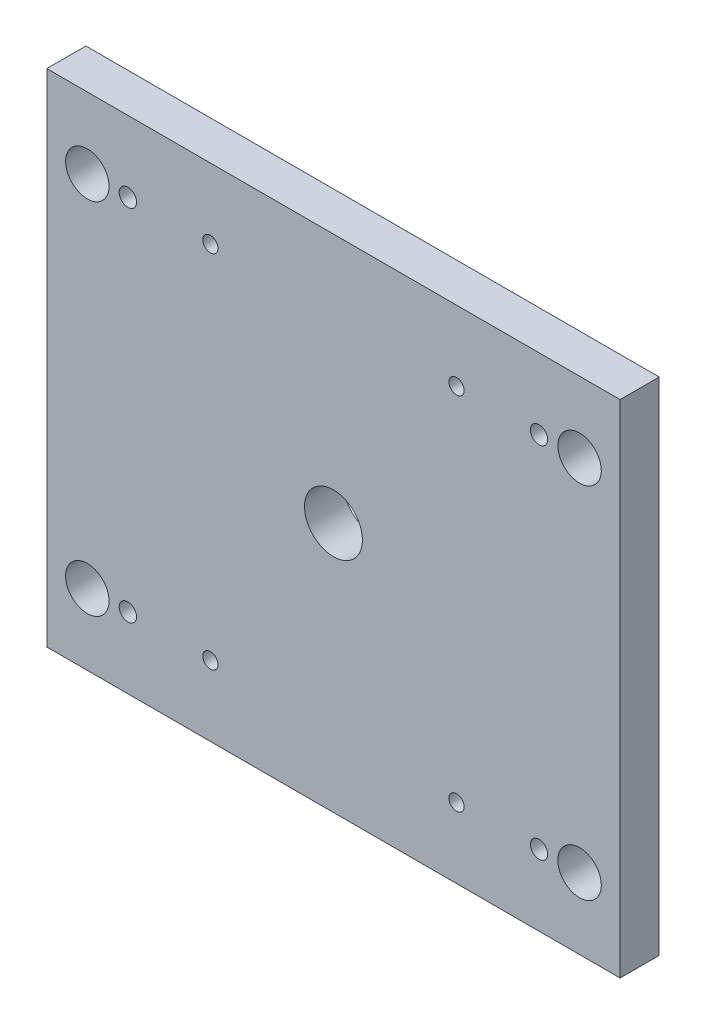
ISO-10303-21;
HEADER;
FILE_DESCRIPTION(('STEP AP214'),'2;1');
FILE_NAME('part.step','',(''),(''),'','','');
FILE_SCHEMA(('AUTOMOTIVE_DESIGN { 1 0 10303 214 1 1 1 1 }'));
ENDSEC;
DATA;
#1=APPLICATION_CONTEXT('core data for automotive mechanical design processes');
#2=APPLICATION_PROTOCOL_DEFINITION('international standard','automotive_design',2000,#1);
#3=PRODUCT_CONTEXT('',#1,'mechanical');
#4=PRODUCT('Part','Part','',(#3));
#5=PRODUCT_RELATED_PRODUCT_CATEGORY('part','',(#4));
#6=PRODUCT_DEFINITION_FORMATION('','',#4);
#7=PRODUCT_DEFINITION_CONTEXT('part definition',#1,'design');
#8=PRODUCT_DEFINITION('design','',#6,#7);
#9=PRODUCT_DEFINITION_SHAPE('','',#8);
#10=(LENGTH_UNIT() NAMED_UNIT(*) SI_UNIT(.MILLI.,.METRE.));
#11=(NAMED_UNIT(*) PLANE_ANGLE_UNIT() SI_UNIT($,.RADIAN.));
#12=(NAMED_UNIT(*) SI_UNIT($,.STERADIAN.) SOLID_ANGLE_UNIT());
#13=UNCERTAINTY_MEASURE_WITH_UNIT(LENGTH_MEASURE(1.E-05),#10,'distance_accuracy_value','');
#14=(GEOMETRIC_REPRESENTATION_CONTEXT(3) GLOBAL_UNCERTAINTY_ASSIGNED_CONTEXT((#13)) GLOBAL_UNIT_ASSIGNED_CONTEXT((#10,
#11,#12)) REPRESENTATION_CONTEXT('',''));
#15=CARTESIAN_POINT('',(0.,0.,0.));
#16=DIRECTION('',(0.,0.,1.));
#17=DIRECTION('',(1.,0.,0.));
#18=AXIS2_PLACEMENT_3D('',#15,#16,#17);
#19=CARTESIAN_POINT('',(-198.,-173.,-195.));
#20=DIRECTION('',(1.,0.,0.));
#21=DIRECTION('',(0.,1.,0.));
#22=AXIS2_PLACEMENT_3D('',#19,#20,#21);
#23=PLANE('',#22);
#24=DIRECTION('',(0.,1.,0.));
#25=VECTOR('',#24,1.);
#26=CARTESIAN_POINT('',(-198.,-173.,-168.));
#27=LINE('',#26,#25);
#28=CARTESIAN_POINT('',(-198.,-173.,-168.));
#29=VERTEX_POINT('',#28);
#30=CARTESIAN_POINT('',(-198.,173.,-168.));
#31=VERTEX_POINT('',#30);
#32=EDGE_CURVE('E77',#29,#31,#27,.T.);
#33=ORIENTED_EDGE('',*,*,#32,.T.);
#34=DIRECTION('',(0.,0.,1.));
#35=VECTOR('',#34,1.);
#36=CARTESIAN_POINT('',(-198.,173.,-195.));
#37=LINE('',#36,#35);
#38=CARTESIAN_POINT('',(-198.,173.,-195.));
#39=VERTEX_POINT('',#38);
#40=EDGE_CURVE('E11',#39,#31,#37,.T.);
#41=ORIENTED_EDGE('',*,*,#40,.F.);
#42=DIRECTION('',(0.,1.,0.));
#43=VECTOR('',#42,1.);
#44=CARTESIAN_POINT('',(-198.,-173.,-195.));
#45=LINE('',#44,#43);
#46=CARTESIAN_POINT('',(-198.,-173.,-195.));
#47=VERTEX_POINT('',#46);
#48=EDGE_CURVE('E67',#47,#39,#45,.T.);
#49=ORIENTED_EDGE('',*,*,#48,.F.);
#50=DIRECTION('',(0.,0.,1.));
#51=VECTOR('',#50,1.);
#52=CARTESIAN_POINT('',(-198.,-173.,-195.));
#53=LINE('',#52,#51);
#54=EDGE_CURVE('E78',#47,#29,#53,.T.);
#55=ORIENTED_EDGE('',*,*,#54,.T.);
#56=EDGE_LOOP('',(#33,#41,#49,#55));
#57=FACE_BOUND('',#56,.T.);
#58=ADVANCED_FACE('F16',(#57),#23,.F.);
#59=CARTESIAN_POINT('',(0.,173.,-195.));
#60=DIRECTION('',(0.,-1.,0.));
#61=DIRECTION('',(1.,0.,0.));
#62=AXIS2_PLACEMENT_3D('',#59,#60,#61);
#63=PLANE('',#62);
#64=DIRECTION('',(1.,0.,0.));
#65=VECTOR('',#64,1.);
#66=CARTESIAN_POINT('',(0.,173.,-168.));
#67=LINE('',#66,#65);
#68=CARTESIAN_POINT('',(198.,173.,-168.));
#69=VERTEX_POINT('',#68);
#70=EDGE_CURVE('E49',#31,#69,#67,.T.);
#71=ORIENTED_EDGE('',*,*,#70,.T.);
#72=DIRECTION('',(0.,0.,1.));
#73=VECTOR('',#72,1.);
#74=CARTESIAN_POINT('',(198.,173.,-195.));
#75=LINE('',#74,#73);
#76=CARTESIAN_POINT('',(198.,173.,-195.));
#77=VERTEX_POINT('',#76);
#78=EDGE_CURVE('E25',#77,#69,#75,.T.);
#79=ORIENTED_EDGE('',*,*,#78,.F.);
#80=DIRECTION('',(1.,0.,0.));
#81=VECTOR('',#80,1.);
#82=CARTESIAN_POINT('',(-198.,173.,-195.));
#83=LINE('',#82,#81);
#84=EDGE_CURVE('E63',#39,#77,#83,.T.);
#85=ORIENTED_EDGE('',*,*,#84,.F.);
#86=ORIENTED_EDGE('',*,*,#40,.T.);
#87=EDGE_LOOP('',(#71,#79,#85,#86));
#88=FACE_BOUND('',#87,.T.);
#89=ADVANCED_FACE('F64',(#88),#63,.F.);
#90=CARTESIAN_POINT('',(198.,173.,-195.));
#91=DIRECTION('',(-1.,0.,0.));
#92=DIRECTION('',(0.,-1.,0.));
#93=AXIS2_PLACEMENT_3D('',#90,#91,#92);
#94=PLANE('',#93);
#95=DIRECTION('',(0.,-1.,0.));
#96=VECTOR('',#95,1.);
#97=CARTESIAN_POINT('',(198.,173.,-168.));
#98=LINE('',#97,#96);
#99=CARTESIAN_POINT('',(198.,-173.,-168.));
#100=VERTEX_POINT('',#99);
#101=EDGE_CURVE('E55',#69,#100,#98,.T.);
#102=ORIENTED_EDGE('',*,*,#101,.T.);
#103=DIRECTION('',(0.,0.,1.));
#104=VECTOR('',#103,1.);
#105=CARTESIAN_POINT('',(198.,-173.,-195.));
#106=LINE('',#105,#104);
#107=CARTESIAN_POINT('',(198.,-173.,-195.));
#108=VERTEX_POINT('',#107);
#109=EDGE_CURVE('E105',#108,#100,#106,.T.);
#110=ORIENTED_EDGE('',*,*,#109,.F.);
#111=DIRECTION('',(0.,-1.,0.));
#112=VECTOR('',#111,1.);
#113=CARTESIAN_POINT('',(198.,173.,-195.));
#114=LINE('',#113,#112);
#115=EDGE_CURVE('E34',#77,#108,#114,.T.);
#116=ORIENTED_EDGE('',*,*,#115,.F.);
#117=ORIENTED_EDGE('',*,*,#78,.T.);
#118=EDGE_LOOP('',(#102,#110,#116,#117));
#119=FACE_BOUND('',#118,.T.);
#120=ADVANCED_FACE('F240',(#119),#94,.F.);
#121=CARTESIAN_POINT('',(170.,-124.,-195.));
#122=DIRECTION('',(0.,0.,1.));
#123=DIRECTION('',(1.,0.,0.));
#124=AXIS2_PLACEMENT_3D('',#121,#122,#123);
#125=CYLINDRICAL_SURFACE('',#124,15.);
#126=CARTESIAN_POINT('',(170.,-124.,-195.));
#127=DIRECTION('',(0.,0.,1.));
#128=DIRECTION('',(0.,1.,0.));
#129=AXIS2_PLACEMENT_3D('',#126,#127,#128);
#130=CIRCLE('',#129,15.);
#131=CARTESIAN_POINT('',(170.,-109.,-195.));
#132=VERTEX_POINT('',#131);
#133=EDGE_CURVE('E204',#132,#132,#130,.T.);
#134=ORIENTED_EDGE('',*,*,#133,.F.);
#135=EDGE_LOOP('',(#134));
#136=FACE_BOUND('',#135,.T.);
#137=CARTESIAN_POINT('',(170.,-124.,-168.));
#138=DIRECTION('',(0.,0.,1.));
#139=DIRECTION('',(0.,1.,0.));
#140=AXIS2_PLACEMENT_3D('',#137,#138,#139);
#141=CIRCLE('',#140,15.);
#142=CARTESIAN_POINT('',(170.,-109.,-168.));
#143=VERTEX_POINT('',#142);
#144=EDGE_CURVE('E100',#143,#143,#141,.T.);
#145=ORIENTED_EDGE('',*,*,#144,.T.);
#146=EDGE_LOOP('',(#145));
#147=FACE_BOUND('',#146,.T.);
#148=ADVANCED_FACE('F244',(#136,#147),#125,.F.);
#149=CARTESIAN_POINT('',(-170.,-124.,-195.));
#150=DIRECTION('',(0.,0.,1.));
#151=DIRECTION('',(1.,0.,0.));
#152=AXIS2_PLACEMENT_3D('',#149,#150,#151);
#153=CYLINDRICAL_SURFACE('',#152,15.);
#154=CARTESIAN_POINT('',(-170.,-124.,-195.));
#155=DIRECTION('',(0.,0.,1.));
#156=DIRECTION('',(0.,1.,0.));
#157=AXIS2_PLACEMENT_3D('',#154,#155,#156);
#158=CIRCLE('',#157,15.);
#159=CARTESIAN_POINT('',(-170.,-109.,-195.));
#160=VERTEX_POINT('',#159);
#161=EDGE_CURVE('E202',#160,#160,#158,.T.);
#162=ORIENTED_EDGE('',*,*,#161,.F.);
#163=EDGE_LOOP('',(#162));
#164=FACE_BOUND('',#163,.T.);
#165=CARTESIAN_POINT('',(-170.,-124.,-168.));
#166=DIRECTION('',(0.,0.,1.));
#167=DIRECTION('',(0.,1.,0.));
#168=AXIS2_PLACEMENT_3D('',#165,#166,#167);
#169=CIRCLE('',#168,15.);
#170=CARTESIAN_POINT('',(-170.,-109.,-168.));
#171=VERTEX_POINT('',#170);
#172=EDGE_CURVE('E97',#171,#171,#169,.T.);
#173=ORIENTED_EDGE('',*,*,#172,.T.);
#174=EDGE_LOOP('',(#173));
#175=FACE_BOUND('',#174,.T.);
#176=ADVANCED_FACE('F253',(#164,#175),#153,.F.);
#177=CARTESIAN_POINT('',(-170.,124.,-195.));
#178=DIRECTION('',(0.,0.,1.));
#179=DIRECTION('',(1.,0.,0.));
#180=AXIS2_PLACEMENT_3D('',#177,#178,#179);
#181=CYLINDRICAL_SURFACE('',#180,15.);
#182=CARTESIAN_POINT('',(-170.,124.,-195.));
#183=DIRECTION('',(0.,0.,1.));
#184=DIRECTION('',(0.,1.,0.));
#185=AXIS2_PLACEMENT_3D('',#182,#183,#184);
#186=CIRCLE('',#185,15.);
#187=CARTESIAN_POINT('',(-170.,139.,-195.));
#188=VERTEX_POINT('',#187);
#189=EDGE_CURVE('E199',#188,#188,#186,.T.);
#190=ORIENTED_EDGE('',*,*,#189,.F.);
#191=EDGE_LOOP('',(#190));
#192=FACE_BOUND('',#191,.T.);
#193=CARTESIAN_POINT('',(-170.,124.,-168.));
#194=DIRECTION('',(0.,0.,1.));
#195=DIRECTION('',(0.,1.,0.));
#196=AXIS2_PLACEMENT_3D('',#193,#194,#195);
#197=CIRCLE('',#196,15.);
#198=CARTESIAN_POINT('',(-170.,139.,-168.));
#199=VERTEX_POINT('',#198);
#200=EDGE_CURVE('E94',#199,#199,#197,.T.);
#201=ORIENTED_EDGE('',*,*,#200,.T.);
#202=EDGE_LOOP('',(#201));
#203=FACE_BOUND('',#202,.T.);
#204=ADVANCED_FACE('F249',(#192,#203),#181,.F.);
#205=CARTESIAN_POINT('',(198.,-173.,-195.));
#206=DIRECTION('',(0.,1.,0.));
#207=DIRECTION('',(-1.,0.,0.));
#208=AXIS2_PLACEMENT_3D('',#205,#206,#207);
#209=PLANE('',#208);
#210=DIRECTION('',(-1.,0.,0.));
#211=VECTOR('',#210,1.);
#212=CARTESIAN_POINT('',(198.,-173.,-168.));
#213=LINE('',#212,#211);
#214=EDGE_CURVE('E92',#100,#29,#213,.T.);
#215=ORIENTED_EDGE('',*,*,#214,.T.);
#216=ORIENTED_EDGE('',*,*,#54,.F.);
#217=DIRECTION('',(-1.,0.,0.));
#218=VECTOR('',#217,1.);
#219=CARTESIAN_POINT('',(198.,-173.,-195.));
#220=LINE('',#219,#218);
#221=EDGE_CURVE('E60',#108,#47,#220,.T.);
#222=ORIENTED_EDGE('',*,*,#221,.F.);
#223=ORIENTED_EDGE('',*,*,#109,.T.);
#224=EDGE_LOOP('',(#215,#216,#222,#223));
#225=FACE_BOUND('',#224,.T.);
#226=ADVANCED_FACE('F215',(#225),#209,.F.);
#227=CARTESIAN_POINT('',(170.,124.,-195.));
#228=DIRECTION('',(0.,0.,1.));
#229=DIRECTION('',(1.,0.,0.));
#230=AXIS2_PLACEMENT_3D('',#227,#228,#229);
#231=CYLINDRICAL_SURFACE('',#230,15.);
#232=CARTESIAN_POINT('',(170.,124.,-195.));
#233=DIRECTION('',(0.,0.,1.));
#234=DIRECTION('',(0.,1.,0.));
#235=AXIS2_PLACEMENT_3D('',#232,#233,#234);
#236=CIRCLE('',#235,15.);
#237=CARTESIAN_POINT('',(170.,139.,-195.));
#238=VERTEX_POINT('',#237);
#239=EDGE_CURVE('E88',#238,#238,#236,.T.);
#240=ORIENTED_EDGE('',*,*,#239,.F.);
#241=EDGE_LOOP('',(#240));
#242=FACE_BOUND('',#241,.T.);
#243=CARTESIAN_POINT('',(170.,124.,-168.));
#244=DIRECTION('',(0.,0.,1.));
#245=DIRECTION('',(0.,1.,0.));
#246=AXIS2_PLACEMENT_3D('',#243,#244,#245);
#247=CIRCLE('',#246,15.);
#248=CARTESIAN_POINT('',(170.,139.,-168.));
#249=VERTEX_POINT('',#248);
#250=EDGE_CURVE('E74',#249,#249,#247,.T.);
#251=ORIENTED_EDGE('',*,*,#250,.T.);
#252=EDGE_LOOP('',(#251));
#253=FACE_BOUND('',#252,.T.);
#254=ADVANCED_FACE('F212',(#242,#253),#231,.F.);
#255=CARTESIAN_POINT('',(-170.,124.,-195.));
#256=DIRECTION('',(0.,0.,1.));
#257=DIRECTION('',(1.,0.,0.));
#258=AXIS2_PLACEMENT_3D('',#255,#256,#257);
#259=PLANE('',#258);
#260=CARTESIAN_POINT('',(85.,-124.5,-195.));
#261=DIRECTION('',(0.,0.,1.));
#262=DIRECTION('',(1.,0.,0.));
#263=AXIS2_PLACEMENT_3D('',#260,#261,#262);
#264=CIRCLE('',#263,8.5);
#265=CARTESIAN_POINT('',(93.5,-124.5,-195.));
#266=VERTEX_POINT('',#265);
#267=EDGE_CURVE('E557',#266,#266,#264,.T.);
#268=ORIENTED_EDGE('',*,*,#267,.T.);
#269=EDGE_LOOP('',(#268));
#270=FACE_BOUND('',#269,.T.);
#271=CARTESIAN_POINT('',(-85.,-124.5,-195.));
#272=DIRECTION('',(0.,0.,1.));
#273=DIRECTION('',(1.,0.,0.));
#274=AXIS2_PLACEMENT_3D('',#271,#272,#273);
#275=CIRCLE('',#274,8.5);
#276=CARTESIAN_POINT('',(-76.5,-124.5,-195.));
#277=VERTEX_POINT('',#276);
#278=EDGE_CURVE('E152',#277,#277,#275,.T.);
#279=ORIENTED_EDGE('',*,*,#278,.T.);
#280=EDGE_LOOP('',(#279));
#281=FACE_BOUND('',#280,.T.);
#282=CARTESIAN_POINT('',(-85.,124.5,-195.));
#283=DIRECTION('',(0.,0.,1.));
#284=DIRECTION('',(1.,0.,0.));
#285=AXIS2_PLACEMENT_3D('',#282,#283,#284);
#286=CIRCLE('',#285,8.5);
#287=CARTESIAN_POINT('',(-76.5,124.5,-195.));
#288=VERTEX_POINT('',#287);
#289=EDGE_CURVE('E139',#288,#288,#286,.T.);
#290=ORIENTED_EDGE('',*,*,#289,.T.);
#291=EDGE_LOOP('',(#290));
#292=FACE_BOUND('',#291,.T.);
#293=CARTESIAN_POINT('',(85.,124.5,-195.));
#294=DIRECTION('',(0.,0.,1.));
#295=DIRECTION('',(1.,0.,0.));
#296=AXIS2_PLACEMENT_3D('',#293,#294,#295);
#297=CIRCLE('',#296,8.5);
#298=CARTESIAN_POINT('',(93.5,124.5,-195.));
#299=VERTEX_POINT('',#298);
#300=EDGE_CURVE('E135',#299,#299,#297,.T.);
#301=ORIENTED_EDGE('',*,*,#300,.T.);
#302=EDGE_LOOP('',(#301));
#303=FACE_BOUND('',#302,.T.);
#304=CARTESIAN_POINT('',(0.,0.,-195.));
#305=DIRECTION('',(0.,0.,-1.));
#306=DIRECTION('',(0.,1.,0.));
#307=AXIS2_PLACEMENT_3D('',#304,#305,#306);
#308=CIRCLE('',#307,20.);
#309=CARTESIAN_POINT('',(0.,19.9999999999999,-195.));
#310=VERTEX_POINT('',#309);
#311=EDGE_CURVE('E128',#310,#310,#308,.T.);
#312=ORIENTED_EDGE('',*,*,#311,.F.);
#313=EDGE_LOOP('',(#312));
#314=FACE_BOUND('',#313,.T.);
#315=CARTESIAN_POINT('',(142.,124.,-195.));
#316=DIRECTION('',(0.,0.,1.));
#317=DIRECTION('',(1.,0.,0.));
#318=AXIS2_PLACEMENT_3D('',#315,#316,#317);
#319=CIRCLE('',#318,9.);
#320=CARTESIAN_POINT('',(151.,124.,-195.));
#321=VERTEX_POINT('',#320);
#322=EDGE_CURVE('E127',#321,#321,#319,.T.);
#323=ORIENTED_EDGE('',*,*,#322,.T.);
#324=EDGE_LOOP('',(#323));
#325=FACE_BOUND('',#324,.T.);
#326=CARTESIAN_POINT('',(-142.,-124.,-195.));
#327=DIRECTION('',(0.,0.,1.));
#328=DIRECTION('',(1.,0.,0.));
#329=AXIS2_PLACEMENT_3D('',#326,#327,#328);
#330=CIRCLE('',#329,9.);
#331=CARTESIAN_POINT('',(-133.,-124.,-195.));
#332=VERTEX_POINT('',#331);
#333=EDGE_CURVE('E122',#332,#332,#330,.T.);
#334=ORIENTED_EDGE('',*,*,#333,.T.);
#335=EDGE_LOOP('',(#334));
#336=FACE_BOUND('',#335,.T.);
#337=CARTESIAN_POINT('',(-142.,124.,-195.));
#338=DIRECTION('',(0.,0.,1.));
#339=DIRECTION('',(1.,0.,0.));
#340=AXIS2_PLACEMENT_3D('',#337,#338,#339);
#341=CIRCLE('',#340,9.);
#342=CARTESIAN_POINT('',(-133.,124.,-195.));
#343=VERTEX_POINT('',#342);
#344=EDGE_CURVE('E117',#343,#343,#341,.T.);
#345=ORIENTED_EDGE('',*,*,#344,.T.);
#346=EDGE_LOOP('',(#345));
#347=FACE_BOUND('',#346,.T.);
#348=CARTESIAN_POINT('',(142.,-124.,-195.));
#349=DIRECTION('',(0.,0.,1.));
#350=DIRECTION('',(1.,0.,0.));
#351=AXIS2_PLACEMENT_3D('',#348,#349,#350);
#352=CIRCLE('',#351,9.);
#353=CARTESIAN_POINT('',(151.,-124.,-195.));
#354=VERTEX_POINT('',#353);
#355=EDGE_CURVE('E112',#354,#354,#352,.T.);
#356=ORIENTED_EDGE('',*,*,#355,.T.);
#357=EDGE_LOOP('',(#356));
#358=FACE_BOUND('',#357,.T.);
#359=ORIENTED_EDGE('',*,*,#48,.T.);
#360=ORIENTED_EDGE('',*,*,#84,.T.);
#361=ORIENTED_EDGE('',*,*,#115,.T.);
#362=ORIENTED_EDGE('',*,*,#221,.T.);
#363=EDGE_LOOP('',(#359,#360,#361,#362));
#364=FACE_BOUND('',#363,.T.);
#365=ORIENTED_EDGE('',*,*,#189,.T.);
#366=EDGE_LOOP('',(#365));
#367=FACE_BOUND('',#366,.T.);
#368=ORIENTED_EDGE('',*,*,#161,.T.);
#369=EDGE_LOOP('',(#368));
#370=FACE_BOUND('',#369,.T.);
#371=ORIENTED_EDGE('',*,*,#133,.T.);
#372=EDGE_LOOP('',(#371));
#373=FACE_BOUND('',#372,.T.);
#374=ORIENTED_EDGE('',*,*,#239,.T.);
#375=EDGE_LOOP('',(#374));
#376=FACE_BOUND('',#375,.T.);
#377=ADVANCED_FACE('F70',(#270,#281,#292,#303,#314,#325,#336,#347,#358,#364,#367,#370,#373,
#376),#259,.F.);
#378=CARTESIAN_POINT('',(-170.,124.,-168.));
#379=DIRECTION('',(0.,0.,1.));
#380=DIRECTION('',(1.,0.,0.));
#381=AXIS2_PLACEMENT_3D('',#378,#379,#380);
#382=PLANE('',#381);
#383=CARTESIAN_POINT('',(85.,-124.5,-168.));
#384=DIRECTION('',(0.,0.,1.));
#385=DIRECTION('',(1.,0.,0.));
#386=AXIS2_PLACEMENT_3D('',#383,#384,#385);
#387=CIRCLE('',#386,5.25);
#388=CARTESIAN_POINT('',(90.25,-124.5,-168.));
#389=VERTEX_POINT('',#388);
#390=EDGE_CURVE('E19',#389,#389,#387,.T.);
#391=ORIENTED_EDGE('',*,*,#390,.F.);
#392=EDGE_LOOP('',(#391));
#393=FACE_BOUND('',#392,.T.);
#394=CARTESIAN_POINT('',(-85.,-124.5,-168.));
#395=DIRECTION('',(0.,0.,1.));
#396=DIRECTION('',(1.,0.,0.));
#397=AXIS2_PLACEMENT_3D('',#394,#395,#396);
#398=CIRCLE('',#397,5.25);
#399=CARTESIAN_POINT('',(-79.75,-124.5,-168.));
#400=VERTEX_POINT('',#399);
#401=EDGE_CURVE('E137',#400,#400,#398,.T.);
#402=ORIENTED_EDGE('',*,*,#401,.F.);
#403=EDGE_LOOP('',(#402));
#404=FACE_BOUND('',#403,.T.);
#405=CARTESIAN_POINT('',(-85.,124.5,-168.));
#406=DIRECTION('',(0.,0.,1.));
#407=DIRECTION('',(1.,0.,0.));
#408=AXIS2_PLACEMENT_3D('',#405,#406,#407);
#409=CIRCLE('',#408,5.25);
#410=CARTESIAN_POINT('',(-79.75,124.5,-168.));
#411=VERTEX_POINT('',#410);
#412=EDGE_CURVE('E133',#411,#411,#409,.T.);
#413=ORIENTED_EDGE('',*,*,#412,.F.);
#414=EDGE_LOOP('',(#413));
#415=FACE_BOUND('',#414,.T.);
#416=CARTESIAN_POINT('',(85.,124.5,-168.));
#417=DIRECTION('',(0.,0.,1.));
#418=DIRECTION('',(1.,0.,0.));
#419=AXIS2_PLACEMENT_3D('',#416,#417,#418);
#420=CIRCLE('',#419,5.25);
#421=CARTESIAN_POINT('',(90.25,124.5,-168.));
#422=VERTEX_POINT('',#421);
#423=EDGE_CURVE('E129',#422,#422,#420,.T.);
#424=ORIENTED_EDGE('',*,*,#423,.F.);
#425=EDGE_LOOP('',(#424));
#426=FACE_BOUND('',#425,.T.);
#427=CARTESIAN_POINT('',(0.,0.,-168.));
#428=DIRECTION('',(0.,0.,1.));
#429=DIRECTION('',(1.,0.,0.));
#430=AXIS2_PLACEMENT_3D('',#427,#428,#429);
#431=CIRCLE('',#430,20.);
#432=CARTESIAN_POINT('',(20.,0.,-168.));
#433=VERTEX_POINT('',#432);
#434=EDGE_CURVE('E124',#433,#433,#431,.T.);
#435=ORIENTED_EDGE('',*,*,#434,.F.);
#436=EDGE_LOOP('',(#435));
#437=FACE_BOUND('',#436,.T.);
#438=CARTESIAN_POINT('',(142.,124.,-168.));
#439=DIRECTION('',(0.,0.,1.));
#440=DIRECTION('',(1.,0.,0.));
#441=AXIS2_PLACEMENT_3D('',#438,#439,#440);
#442=CIRCLE('',#441,6.);
#443=CARTESIAN_POINT('',(148.,124.,-168.));
#444=VERTEX_POINT('',#443);
#445=EDGE_CURVE('E119',#444,#444,#442,.T.);
#446=ORIENTED_EDGE('',*,*,#445,.F.);
#447=EDGE_LOOP('',(#446));
#448=FACE_BOUND('',#447,.T.);
#449=CARTESIAN_POINT('',(-142.,-124.,-168.));
#450=DIRECTION('',(0.,0.,1.));
#451=DIRECTION('',(1.,0.,0.));
#452=AXIS2_PLACEMENT_3D('',#449,#450,#451);
#453=CIRCLE('',#452,6.);
#454=CARTESIAN_POINT('',(-136.,-124.,-168.));
#455=VERTEX_POINT('',#454);
#456=EDGE_CURVE('E114',#455,#455,#453,.T.);
#457=ORIENTED_EDGE('',*,*,#456,.F.);
#458=EDGE_LOOP('',(#457));
#459=FACE_BOUND('',#458,.T.);
#460=CARTESIAN_POINT('',(-142.,124.,-168.));
#461=DIRECTION('',(0.,0.,1.));
#462=DIRECTION('',(1.,0.,0.));
#463=AXIS2_PLACEMENT_3D('',#460,#461,#462);
#464=CIRCLE('',#463,6.);
#465=CARTESIAN_POINT('',(-136.,124.,-168.));
#466=VERTEX_POINT('',#465);
#467=EDGE_CURVE('E109',#466,#466,#464,.T.);
#468=ORIENTED_EDGE('',*,*,#467,.F.);
#469=EDGE_LOOP('',(#468));
#470=FACE_BOUND('',#469,.T.);
#471=CARTESIAN_POINT('',(142.,-124.,-168.));
#472=DIRECTION('',(0.,0.,1.));
#473=DIRECTION('',(1.,0.,0.));
#474=AXIS2_PLACEMENT_3D('',#471,#472,#473);
#475=CIRCLE('',#474,6.);
#476=CARTESIAN_POINT('',(148.,-124.,-168.));
#477=VERTEX_POINT('',#476);
#478=EDGE_CURVE('E81',#477,#477,#475,.T.);
#479=ORIENTED_EDGE('',*,*,#478,.F.);
#480=EDGE_LOOP('',(#479));
#481=FACE_BOUND('',#480,.T.);
#482=ORIENTED_EDGE('',*,*,#32,.F.);
#483=ORIENTED_EDGE('',*,*,#214,.F.);
#484=ORIENTED_EDGE('',*,*,#101,.F.);
#485=ORIENTED_EDGE('',*,*,#70,.F.);
#486=EDGE_LOOP('',(#482,#483,#484,#485));
#487=FACE_BOUND('',#486,.T.);
#488=ORIENTED_EDGE('',*,*,#200,.F.);
#489=EDGE_LOOP('',(#488));
#490=FACE_BOUND('',#489,.T.);
#491=ORIENTED_EDGE('',*,*,#172,.F.);
#492=EDGE_LOOP('',(#491));
#493=FACE_BOUND('',#492,.T.);
#494=ORIENTED_EDGE('',*,*,#144,.F.);
#495=EDGE_LOOP('',(#494));
#496=FACE_BOUND('',#495,.T.);
#497=ORIENTED_EDGE('',*,*,#250,.F.);
#498=EDGE_LOOP('',(#497));
#499=FACE_BOUND('',#498,.T.);
#500=ADVANCED_FACE('F219',(#393,#404,#415,#426,#437,#448,#459,#470,#481,#487,#490,#493,#496,
#499),#382,.T.);
#501=CARTESIAN_POINT('',(142.,-124.,38.3441550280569));
#502=DIRECTION('',(0.,0.,1.));
#503=DIRECTION('',(1.,0.,0.));
#504=AXIS2_PLACEMENT_3D('',#501,#502,#503);
#505=CYLINDRICAL_SURFACE('',#504,6.);
#506=ORIENTED_EDGE('',*,*,#478,.T.);
#507=EDGE_LOOP('',(#506));
#508=FACE_BOUND('',#507,.T.);
#509=CARTESIAN_POINT('',(142.,-124.,-179.5));
#510=DIRECTION('',(0.,0.,1.));
#511=DIRECTION('',(1.,0.,0.));
#512=AXIS2_PLACEMENT_3D('',#509,#510,#511);
#513=CIRCLE('',#512,6.);
#514=CARTESIAN_POINT('',(148.,-124.,-179.5));
#515=VERTEX_POINT('',#514);
#516=EDGE_CURVE('E85',#515,#515,#513,.T.);
#517=ORIENTED_EDGE('',*,*,#516,.F.);
#518=EDGE_LOOP('',(#517));
#519=FACE_BOUND('',#518,.T.);
#520=ADVANCED_FACE('F221',(#508,#519),#505,.F.);
#521=CARTESIAN_POINT('',(142.,-124.,-179.5));
#522=DIRECTION('',(0.,0.,1.));
#523=DIRECTION('',(1.,0.,0.));
#524=AXIS2_PLACEMENT_3D('',#521,#522,#523);
#525=PLANE('',#524);
#526=ORIENTED_EDGE('',*,*,#516,.T.);
#527=EDGE_LOOP('',(#526));
#528=FACE_BOUND('',#527,.T.);
#529=CARTESIAN_POINT('',(142.,-124.,-179.5));
#530=DIRECTION('',(0.,0.,1.));
#531=DIRECTION('',(1.,0.,0.));
#532=AXIS2_PLACEMENT_3D('',#529,#530,#531);
#533=CIRCLE('',#532,9.);
#534=CARTESIAN_POINT('',(151.,-124.,-179.5));
#535=VERTEX_POINT('',#534);
#536=EDGE_CURVE('E192',#535,#535,#533,.T.);
#537=ORIENTED_EDGE('',*,*,#536,.F.);
#538=EDGE_LOOP('',(#537));
#539=FACE_BOUND('',#538,.T.);
#540=ADVANCED_FACE('F229',(#528,#539),#525,.F.);
#541=CARTESIAN_POINT('',(142.,-124.,-195.));
#542=DIRECTION('',(0.,0.,1.));
#543=DIRECTION('',(1.,0.,0.));
#544=AXIS2_PLACEMENT_3D('',#541,#542,#543);
#545=CYLINDRICAL_SURFACE('',#544,9.);
#546=ORIENTED_EDGE('',*,*,#536,.T.);
#547=EDGE_LOOP('',(#546));
#548=FACE_BOUND('',#547,.T.);
#549=ORIENTED_EDGE('',*,*,#355,.F.);
#550=EDGE_LOOP('',(#549));
#551=FACE_BOUND('',#550,.T.);
#552=ADVANCED_FACE('F318',(#548,#551),#545,.F.);
#553=CARTESIAN_POINT('',(-142.,124.,38.3441550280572));
#554=DIRECTION('',(0.,0.,1.));
#555=DIRECTION('',(1.,0.,0.));
#556=AXIS2_PLACEMENT_3D('',#553,#554,#555);
#557=CYLINDRICAL_SURFACE('',#556,6.);
#558=ORIENTED_EDGE('',*,*,#467,.T.);
#559=EDGE_LOOP('',(#558));
#560=FACE_BOUND('',#559,.T.);
#561=CARTESIAN_POINT('',(-142.,124.,-179.5));
#562=DIRECTION('',(0.,0.,1.));
#563=DIRECTION('',(1.,0.,0.));
#564=AXIS2_PLACEMENT_3D('',#561,#562,#563);
#565=CIRCLE('',#564,6.);
#566=CARTESIAN_POINT('',(-136.,124.,-179.5));
#567=VERTEX_POINT('',#566);
#568=EDGE_CURVE('E113',#567,#567,#565,.T.);
#569=ORIENTED_EDGE('',*,*,#568,.F.);
#570=EDGE_LOOP('',(#569));
#571=FACE_BOUND('',#570,.T.);
#572=ADVANCED_FACE('F328',(#560,#571),#557,.F.);
#573=CARTESIAN_POINT('',(-142.,124.,-179.5));
#574=DIRECTION('',(0.,0.,1.));
#575=DIRECTION('',(1.,0.,0.));
#576=AXIS2_PLACEMENT_3D('',#573,#574,#575);
#577=PLANE('',#576);
#578=ORIENTED_EDGE('',*,*,#568,.T.);
#579=EDGE_LOOP('',(#578));
#580=FACE_BOUND('',#579,.T.);
#581=CARTESIAN_POINT('',(-142.,124.,-179.5));
#582=DIRECTION('',(0.,0.,1.));
#583=DIRECTION('',(1.,0.,0.));
#584=AXIS2_PLACEMENT_3D('',#581,#582,#583);
#585=CIRCLE('',#584,9.);
#586=CARTESIAN_POINT('',(-133.,124.,-179.5));
#587=VERTEX_POINT('',#586);
#588=EDGE_CURVE('E185',#587,#587,#585,.T.);
#589=ORIENTED_EDGE('',*,*,#588,.F.);
#590=EDGE_LOOP('',(#589));
#591=FACE_BOUND('',#590,.T.);
#592=ADVANCED_FACE('F338',(#580,#591),#577,.F.);
#593=CARTESIAN_POINT('',(-142.,124.,-195.));
#594=DIRECTION('',(0.,0.,1.));
#595=DIRECTION('',(1.,0.,0.));
#596=AXIS2_PLACEMENT_3D('',#593,#594,#595);
#597=CYLINDRICAL_SURFACE('',#596,9.);
#598=ORIENTED_EDGE('',*,*,#588,.T.);
#599=EDGE_LOOP('',(#598));
#600=FACE_BOUND('',#599,.T.);
#601=ORIENTED_EDGE('',*,*,#344,.F.);
#602=EDGE_LOOP('',(#601));
#603=FACE_BOUND('',#602,.T.);
#604=ADVANCED_FACE('F348',(#600,#603),#597,.F.);
#605=CARTESIAN_POINT('',(-142.,-124.,38.3441550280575));
#606=DIRECTION('',(0.,0.,1.));
#607=DIRECTION('',(1.,0.,0.));
#608=AXIS2_PLACEMENT_3D('',#605,#606,#607);
#609=CYLINDRICAL_SURFACE('',#608,6.);
#610=ORIENTED_EDGE('',*,*,#456,.T.);
#611=EDGE_LOOP('',(#610));
#612=FACE_BOUND('',#611,.T.);
#613=CARTESIAN_POINT('',(-142.,-124.,-179.5));
#614=DIRECTION('',(0.,0.,1.));
#615=DIRECTION('',(1.,0.,0.));
#616=AXIS2_PLACEMENT_3D('',#613,#614,#615);
#617=CIRCLE('',#616,6.);
#618=CARTESIAN_POINT('',(-136.,-124.,-179.5));
#619=VERTEX_POINT('',#618);
#620=EDGE_CURVE('E118',#619,#619,#617,.T.);
#621=ORIENTED_EDGE('',*,*,#620,.F.);
#622=EDGE_LOOP('',(#621));
#623=FACE_BOUND('',#622,.T.);
#624=ADVANCED_FACE('F358',(#612,#623),#609,.F.);
#625=CARTESIAN_POINT('',(-142.,-124.,-179.5));
#626=DIRECTION('',(0.,0.,1.));
#627=DIRECTION('',(1.,0.,0.));
#628=AXIS2_PLACEMENT_3D('',#625,#626,#627);
#629=PLANE('',#628);
#630=ORIENTED_EDGE('',*,*,#620,.T.);
#631=EDGE_LOOP('',(#630));
#632=FACE_BOUND('',#631,.T.);
#633=CARTESIAN_POINT('',(-142.,-124.,-179.5));
#634=DIRECTION('',(0.,0.,1.));
#635=DIRECTION('',(1.,0.,0.));
#636=AXIS2_PLACEMENT_3D('',#633,#634,#635);
#637=CIRCLE('',#636,9.);
#638=CARTESIAN_POINT('',(-133.,-124.,-179.5));
#639=VERTEX_POINT('',#638);
#640=EDGE_CURVE('E178',#639,#639,#637,.T.);
#641=ORIENTED_EDGE('',*,*,#640,.F.);
#642=EDGE_LOOP('',(#641));
#643=FACE_BOUND('',#642,.T.);
#644=ADVANCED_FACE('F368',(#632,#643),#629,.F.);
#645=CARTESIAN_POINT('',(-142.,-124.,-195.));
#646=DIRECTION('',(0.,0.,1.));
#647=DIRECTION('',(1.,0.,0.));
#648=AXIS2_PLACEMENT_3D('',#645,#646,#647);
#649=CYLINDRICAL_SURFACE('',#648,9.);
#650=ORIENTED_EDGE('',*,*,#640,.T.);
#651=EDGE_LOOP('',(#650));
#652=FACE_BOUND('',#651,.T.);
#653=ORIENTED_EDGE('',*,*,#333,.F.);
#654=EDGE_LOOP('',(#653));
#655=FACE_BOUND('',#654,.T.);
#656=ADVANCED_FACE('F378',(#652,#655),#649,.F.);
#657=CARTESIAN_POINT('',(142.,124.,38.3441550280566));
#658=DIRECTION('',(0.,0.,1.));
#659=DIRECTION('',(1.,0.,0.));
#660=AXIS2_PLACEMENT_3D('',#657,#658,#659);
#661=CYLINDRICAL_SURFACE('',#660,6.);
#662=ORIENTED_EDGE('',*,*,#445,.T.);
#663=EDGE_LOOP('',(#662));
#664=FACE_BOUND('',#663,.T.);
#665=CARTESIAN_POINT('',(142.,124.,-179.5));
#666=DIRECTION('',(0.,0.,1.));
#667=DIRECTION('',(1.,0.,0.));
#668=AXIS2_PLACEMENT_3D('',#665,#666,#667);
#669=CIRCLE('',#668,6.);
#670=CARTESIAN_POINT('',(148.,124.,-179.5));
#671=VERTEX_POINT('',#670);
#672=EDGE_CURVE('E123',#671,#671,#669,.T.);
#673=ORIENTED_EDGE('',*,*,#672,.F.);
#674=EDGE_LOOP('',(#673));
#675=FACE_BOUND('',#674,.T.);
#676=ADVANCED_FACE('F388',(#664,#675),#661,.F.);
#677=CARTESIAN_POINT('',(142.,124.,-179.5));
#678=DIRECTION('',(0.,0.,1.));
#679=DIRECTION('',(1.,0.,0.));
#680=AXIS2_PLACEMENT_3D('',#677,#678,#679);
#681=PLANE('',#680);
#682=ORIENTED_EDGE('',*,*,#672,.T.);
#683=EDGE_LOOP('',(#682));
#684=FACE_BOUND('',#683,.T.);
#685=CARTESIAN_POINT('',(142.,124.,-179.5));
#686=DIRECTION('',(0.,0.,1.));
#687=DIRECTION('',(1.,0.,0.));
#688=AXIS2_PLACEMENT_3D('',#685,#686,#687);
#689=CIRCLE('',#688,9.);
#690=CARTESIAN_POINT('',(151.,124.,-179.5));
#691=VERTEX_POINT('',#690);
#692=EDGE_CURVE('E171',#691,#691,#689,.T.);
#693=ORIENTED_EDGE('',*,*,#692,.F.);
#694=EDGE_LOOP('',(#693));
#695=FACE_BOUND('',#694,.T.);
#696=ADVANCED_FACE('F398',(#684,#695),#681,.F.);
#697=CARTESIAN_POINT('',(142.,124.,-195.));
#698=DIRECTION('',(0.,0.,1.));
#699=DIRECTION('',(1.,0.,0.));
#700=AXIS2_PLACEMENT_3D('',#697,#698,#699);
#701=CYLINDRICAL_SURFACE('',#700,9.);
#702=ORIENTED_EDGE('',*,*,#692,.T.);
#703=EDGE_LOOP('',(#702));
#704=FACE_BOUND('',#703,.T.);
#705=ORIENTED_EDGE('',*,*,#322,.F.);
#706=EDGE_LOOP('',(#705));
#707=FACE_BOUND('',#706,.T.);
#708=ADVANCED_FACE('F408',(#704,#707),#701,.F.);
#709=CARTESIAN_POINT('',(0.,0.,96.5));
#710=DIRECTION('',(0.,0.,-1.));
#711=DIRECTION('',(-1.,0.,0.));
#712=AXIS2_PLACEMENT_3D('',#709,#710,#711);
#713=CYLINDRICAL_SURFACE('',#712,20.);
#714=ORIENTED_EDGE('',*,*,#434,.T.);
#715=EDGE_LOOP('',(#714));
#716=FACE_BOUND('',#715,.T.);
#717=ORIENTED_EDGE('',*,*,#311,.T.);
#718=EDGE_LOOP('',(#717));
#719=FACE_BOUND('',#718,.T.);
#720=ADVANCED_FACE('F418',(#716,#719),#713,.F.);
#721=CARTESIAN_POINT('',(85.,124.5,65.7775818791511));
#722=DIRECTION('',(0.,0.,1.));
#723=DIRECTION('',(1.,0.,0.));
#724=AXIS2_PLACEMENT_3D('',#721,#722,#723);
#725=CYLINDRICAL_SURFACE('',#724,5.25);
#726=ORIENTED_EDGE('',*,*,#423,.T.);
#727=EDGE_LOOP('',(#726));
#728=FACE_BOUND('',#727,.T.);
#729=CARTESIAN_POINT('',(85.,124.5,-184.));
#730=DIRECTION('',(0.,0.,1.));
#731=DIRECTION('',(1.,0.,0.));
#732=AXIS2_PLACEMENT_3D('',#729,#730,#731);
#733=CIRCLE('',#732,5.25);
#734=CARTESIAN_POINT('',(90.25,124.5,-184.));
#735=VERTEX_POINT('',#734);
#736=EDGE_CURVE('E132',#735,#735,#733,.T.);
#737=ORIENTED_EDGE('',*,*,#736,.F.);
#738=EDGE_LOOP('',(#737));
#739=FACE_BOUND('',#738,.T.);
#740=ADVANCED_FACE('F428',(#728,#739),#725,.F.);
#741=CARTESIAN_POINT('',(85.,124.5,-184.));
#742=DIRECTION('',(0.,0.,1.));
#743=DIRECTION('',(1.,0.,0.));
#744=AXIS2_PLACEMENT_3D('',#741,#742,#743);
#745=PLANE('',#744);
#746=ORIENTED_EDGE('',*,*,#736,.T.);
#747=EDGE_LOOP('',(#746));
#748=FACE_BOUND('',#747,.T.);
#749=CARTESIAN_POINT('',(85.,124.5,-184.));
#750=DIRECTION('',(0.,0.,1.));
#751=DIRECTION('',(1.,0.,0.));
#752=AXIS2_PLACEMENT_3D('',#749,#750,#751);
#753=CIRCLE('',#752,8.5);
#754=CARTESIAN_POINT('',(93.5,124.5,-184.));
#755=VERTEX_POINT('',#754);
#756=EDGE_CURVE('E162',#755,#755,#753,.T.);
#757=ORIENTED_EDGE('',*,*,#756,.F.);
#758=EDGE_LOOP('',(#757));
#759=FACE_BOUND('',#758,.T.);
#760=ADVANCED_FACE('F438',(#748,#759),#745,.F.);
#761=CARTESIAN_POINT('',(85.,124.5,-195.));
#762=DIRECTION('',(0.,0.,1.));
#763=DIRECTION('',(1.,0.,0.));
#764=AXIS2_PLACEMENT_3D('',#761,#762,#763);
#765=CYLINDRICAL_SURFACE('',#764,8.5);
#766=ORIENTED_EDGE('',*,*,#756,.T.);
#767=EDGE_LOOP('',(#766));
#768=FACE_BOUND('',#767,.T.);
#769=ORIENTED_EDGE('',*,*,#300,.F.);
#770=EDGE_LOOP('',(#769));
#771=FACE_BOUND('',#770,.T.);
#772=ADVANCED_FACE('F448',(#768,#771),#765,.F.);
#773=CARTESIAN_POINT('',(-85.,124.5,65.7775818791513));
#774=DIRECTION('',(0.,0.,1.));
#775=DIRECTION('',(1.,0.,0.));
#776=AXIS2_PLACEMENT_3D('',#773,#774,#775);
#777=CYLINDRICAL_SURFACE('',#776,5.25);
#778=ORIENTED_EDGE('',*,*,#412,.T.);
#779=EDGE_LOOP('',(#778));
#780=FACE_BOUND('',#779,.T.);
#781=CARTESIAN_POINT('',(-85.,124.5,-184.));
#782=DIRECTION('',(0.,0.,1.));
#783=DIRECTION('',(1.,0.,0.));
#784=AXIS2_PLACEMENT_3D('',#781,#782,#783);
#785=CIRCLE('',#784,5.25);
#786=CARTESIAN_POINT('',(-79.75,124.5,-184.));
#787=VERTEX_POINT('',#786);
#788=EDGE_CURVE('E136',#787,#787,#785,.T.);
#789=ORIENTED_EDGE('',*,*,#788,.F.);
#790=EDGE_LOOP('',(#789));
#791=FACE_BOUND('',#790,.T.);
#792=ADVANCED_FACE('F458',(#780,#791),#777,.F.);
#793=CARTESIAN_POINT('',(-85.,124.5,-184.));
#794=DIRECTION('',(0.,0.,1.));
#795=DIRECTION('',(1.,0.,0.));
#796=AXIS2_PLACEMENT_3D('',#793,#794,#795);
#797=PLANE('',#796);
#798=ORIENTED_EDGE('',*,*,#788,.T.);
#799=EDGE_LOOP('',(#798));
#800=FACE_BOUND('',#799,.T.);
#801=CARTESIAN_POINT('',(-85.,124.5,-184.));
#802=DIRECTION('',(0.,0.,1.));
#803=DIRECTION('',(1.,0.,0.));
#804=AXIS2_PLACEMENT_3D('',#801,#802,#803);
#805=CIRCLE('',#804,8.5);
#806=CARTESIAN_POINT('',(-76.5,124.5,-184.));
#807=VERTEX_POINT('',#806);
#808=EDGE_CURVE('E144',#807,#807,#805,.T.);
#809=ORIENTED_EDGE('',*,*,#808,.F.);
#810=EDGE_LOOP('',(#809));
#811=FACE_BOUND('',#810,.T.);
#812=ADVANCED_FACE('F468',(#800,#811),#797,.F.);
#813=CARTESIAN_POINT('',(-85.,124.5,-195.));
#814=DIRECTION('',(0.,0.,1.));
#815=DIRECTION('',(1.,0.,0.));
#816=AXIS2_PLACEMENT_3D('',#813,#814,#815);
#817=CYLINDRICAL_SURFACE('',#816,8.5);
#818=ORIENTED_EDGE('',*,*,#808,.T.);
#819=EDGE_LOOP('',(#818));
#820=FACE_BOUND('',#819,.T.);
#821=ORIENTED_EDGE('',*,*,#289,.F.);
#822=EDGE_LOOP('',(#821));
#823=FACE_BOUND('',#822,.T.);
#824=ADVANCED_FACE('F478',(#820,#823),#817,.F.);
#825=CARTESIAN_POINT('',(-85.,-124.5,65.7775818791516));
#826=DIRECTION('',(0.,0.,1.));
#827=DIRECTION('',(1.,0.,0.));
#828=AXIS2_PLACEMENT_3D('',#825,#826,#827);
#829=CYLINDRICAL_SURFACE('',#828,5.25);
#830=ORIENTED_EDGE('',*,*,#401,.T.);
#831=EDGE_LOOP('',(#830));
#832=FACE_BOUND('',#831,.T.);
#833=CARTESIAN_POINT('',(-85.,-124.5,-184.));
#834=DIRECTION('',(0.,0.,1.));
#835=DIRECTION('',(1.,0.,0.));
#836=AXIS2_PLACEMENT_3D('',#833,#834,#835);
#837=CIRCLE('',#836,5.25);
#838=CARTESIAN_POINT('',(-79.75,-124.5,-184.));
#839=VERTEX_POINT('',#838);
#840=EDGE_CURVE('E140',#839,#839,#837,.T.);
#841=ORIENTED_EDGE('',*,*,#840,.F.);
#842=EDGE_LOOP('',(#841));
#843=FACE_BOUND('',#842,.T.);
#844=ADVANCED_FACE('F488',(#832,#843),#829,.F.);
#845=CARTESIAN_POINT('',(-85.,-124.5,-184.));
#846=DIRECTION('',(0.,0.,1.));
#847=DIRECTION('',(1.,0.,0.));
#848=AXIS2_PLACEMENT_3D('',#845,#846,#847);
#849=PLANE('',#848);
#850=ORIENTED_EDGE('',*,*,#840,.T.);
#851=EDGE_LOOP('',(#850));
#852=FACE_BOUND('',#851,.T.);
#853=CARTESIAN_POINT('',(-85.,-124.5,-184.));
#854=DIRECTION('',(0.,0.,1.));
#855=DIRECTION('',(1.,0.,0.));
#856=AXIS2_PLACEMENT_3D('',#853,#854,#855);
#857=CIRCLE('',#856,8.5);
#858=CARTESIAN_POINT('',(-76.5,-124.5,-184.));
#859=VERTEX_POINT('',#858);
#860=EDGE_CURVE('E147',#859,#859,#857,.T.);
#861=ORIENTED_EDGE('',*,*,#860,.F.);
#862=EDGE_LOOP('',(#861));
#863=FACE_BOUND('',#862,.T.);
#864=ADVANCED_FACE('F498',(#852,#863),#849,.F.);
#865=CARTESIAN_POINT('',(-85.,-124.5,-195.));
#866=DIRECTION('',(0.,0.,1.));
#867=DIRECTION('',(1.,0.,0.));
#868=AXIS2_PLACEMENT_3D('',#865,#866,#867);
#869=CYLINDRICAL_SURFACE('',#868,8.5);
#870=ORIENTED_EDGE('',*,*,#860,.T.);
#871=EDGE_LOOP('',(#870));
#872=FACE_BOUND('',#871,.T.);
#873=ORIENTED_EDGE('',*,*,#278,.F.);
#874=EDGE_LOOP('',(#873));
#875=FACE_BOUND('',#874,.T.);
#876=ADVANCED_FACE('F507',(#872,#875),#869,.F.);
#877=CARTESIAN_POINT('',(85.,-124.5,65.7775818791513));
#878=DIRECTION('',(0.,0.,1.));
#879=DIRECTION('',(1.,0.,0.));
#880=AXIS2_PLACEMENT_3D('',#877,#878,#879);
#881=CYLINDRICAL_SURFACE('',#880,5.25);
#882=ORIENTED_EDGE('',*,*,#390,.T.);
#883=EDGE_LOOP('',(#882));
#884=FACE_BOUND('',#883,.T.);
#885=CARTESIAN_POINT('',(85.,-124.5,-184.));
#886=DIRECTION('',(0.,0.,1.));
#887=DIRECTION('',(1.,0.,0.));
#888=AXIS2_PLACEMENT_3D('',#885,#886,#887);
#889=CIRCLE('',#888,5.25);
#890=CARTESIAN_POINT('',(90.25,-124.5,-184.));
#891=VERTEX_POINT('',#890);
#892=EDGE_CURVE('E559',#891,#891,#889,.T.);
#893=ORIENTED_EDGE('',*,*,#892,.F.);
#894=EDGE_LOOP('',(#893));
#895=FACE_BOUND('',#894,.T.);
#896=ADVANCED_FACE('F516',(#884,#895),#881,.F.);
#897=CARTESIAN_POINT('',(85.,-124.5,-184.));
#898=DIRECTION('',(0.,0.,1.));
#899=DIRECTION('',(1.,0.,0.));
#900=AXIS2_PLACEMENT_3D('',#897,#898,#899);
#901=PLANE('',#900);
#902=ORIENTED_EDGE('',*,*,#892,.T.);
#903=EDGE_LOOP('',(#902));
#904=FACE_BOUND('',#903,.T.);
#905=CARTESIAN_POINT('',(85.,-124.5,-184.));
#906=DIRECTION('',(0.,0.,1.));
#907=DIRECTION('',(1.,0.,0.));
#908=AXIS2_PLACEMENT_3D('',#905,#906,#907);
#909=CIRCLE('',#908,8.5);
#910=CARTESIAN_POINT('',(93.5,-124.5,-184.));
#911=VERTEX_POINT('',#910);
#912=EDGE_CURVE('E554',#911,#911,#909,.T.);
#913=ORIENTED_EDGE('',*,*,#912,.F.);
#914=EDGE_LOOP('',(#913));
#915=FACE_BOUND('',#914,.T.);
#916=ADVANCED_FACE('F526',(#904,#915),#901,.F.);
#917=CARTESIAN_POINT('',(85.,-124.5,-195.));
#918=DIRECTION('',(0.,0.,1.));
#919=DIRECTION('',(1.,0.,0.));
#920=AXIS2_PLACEMENT_3D('',#917,#918,#919);
#921=CYLINDRICAL_SURFACE('',#920,8.5);
#922=ORIENTED_EDGE('',*,*,#912,.T.);
#923=EDGE_LOOP('',(#922));
#924=FACE_BOUND('',#923,.T.);
#925=ORIENTED_EDGE('',*,*,#267,.F.);
#926=EDGE_LOOP('',(#925));
#927=FACE_BOUND('',#926,.T.);
#928=ADVANCED_FACE('F536',(#924,#927),#921,.F.);
#929=CLOSED_SHELL('',(#58,#89,#120,#148,#176,#204,#226,#254,#377,#500,#520,#540,#552,#572,#592,
#604,#624,#644,#656,#676,#696,#708,#720,#740,#760,#772,#792,#812,#824,#844,#864,#876,#896,#916,#928));
#930=MANIFOLD_SOLID_BREP('B1',#929);
#931=ADVANCED_BREP_SHAPE_REPRESENTATION('',(#18,#930),#14);
#932=SHAPE_DEFINITION_REPRESENTATION(#9,#931);
ENDSEC;
END-ISO-10303-21;
